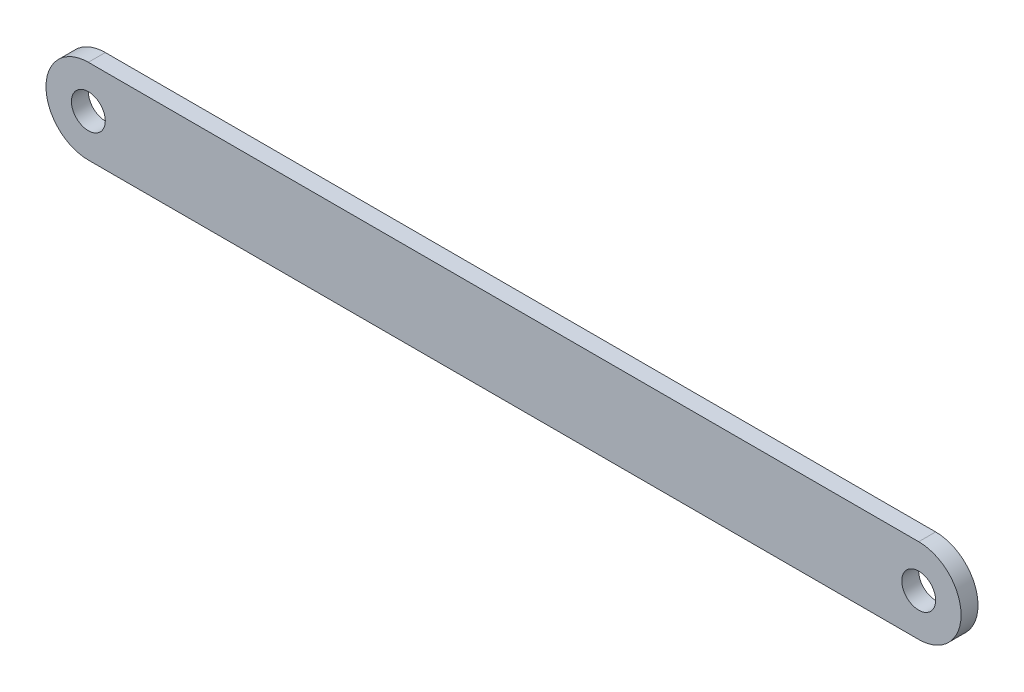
from build123d import *

# Parameters (mm, degrees)
BOSS_EXTRUDE1_DEPTH  = 5
M8_CLEARANCE_HOLE2_D = 10
M8_CLEARANCE_HOLE1_D = 10


with BuildPart() as part:
    # Sketch1 → Boss-Extrude1 (new body)
    with BuildSketch(Plane.XY):
        with BuildLine():
            Line((-122.546996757, 12.5), (122.546996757, 12.5))
            ThreePointArc((122.546996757, 12.5), (135.046996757, 0), (122.546996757, -12.5))
            Line((122.546996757, -12.5), (-122.546996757, -12.5))
            ThreePointArc((-122.546996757, -12.5), (-135.046996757, 0), (-122.546996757, 12.5))
        make_face()
    extrude(amount=BOSS_EXTRUDE1_DEPTH)

    # M8 Clearance Hole2 (through all)
    with Locations(Plane.XY.offset(5)):
        with Locations((-122.546996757, 0)):
            Hole(M8_CLEARANCE_HOLE2_D / 2)

    # M8 Clearance Hole1 (through all)
    with Locations(Plane.XY.offset(5)):
        with Locations((122.546996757, 0)):
            Hole(M8_CLEARANCE_HOLE1_D / 2)


solid = part.part
